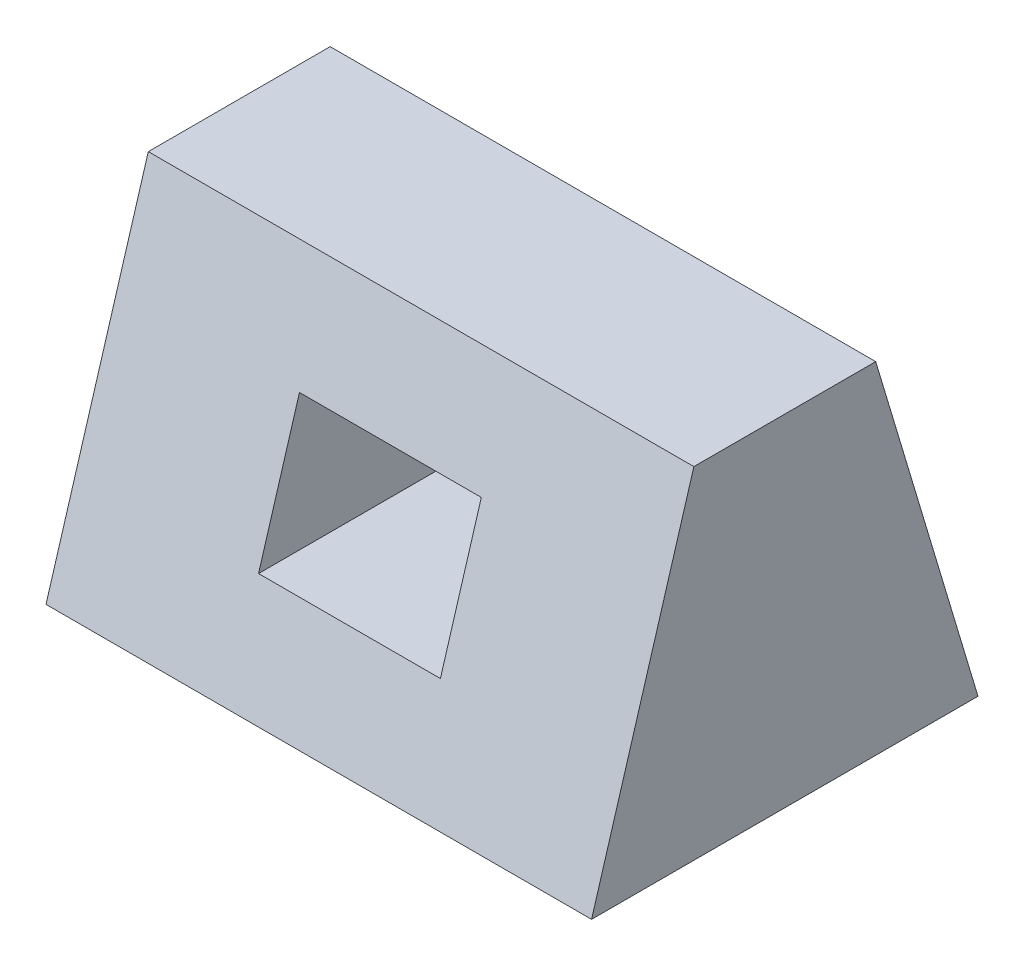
from build123d import *

# Parameters (mm, degrees)
EXTRUDE_1_DEPTH     = 120
SKETCH_3_W          = 40
SKETCH_3_H          = 30
CUT_EXTRUDE_2_DEPTH = 40


with BuildPart() as part:
    # Sketch 1 → Extrude 1 (new body)
    with BuildSketch(Plane(origin=(0, 0, 0), x_dir=(0, 0, -1), z_dir=(1, 0, 0))):
        Polygon((-42.5, 0), (42.5, 0), (20, 75), (-20, 75), align=None)
    extrude(amount=EXTRUDE_1_DEPTH)

    # Sketch 3 → Cut-Extrude 2 (cut, symmetric)
    with BuildSketch(Plane.XY):
        with Locations((60, 37.5)):
            Rectangle(SKETCH_3_W, SKETCH_3_H)
    extrude(amount=CUT_EXTRUDE_2_DEPTH, both=True, mode=Mode.SUBTRACT)


solid = part.part
